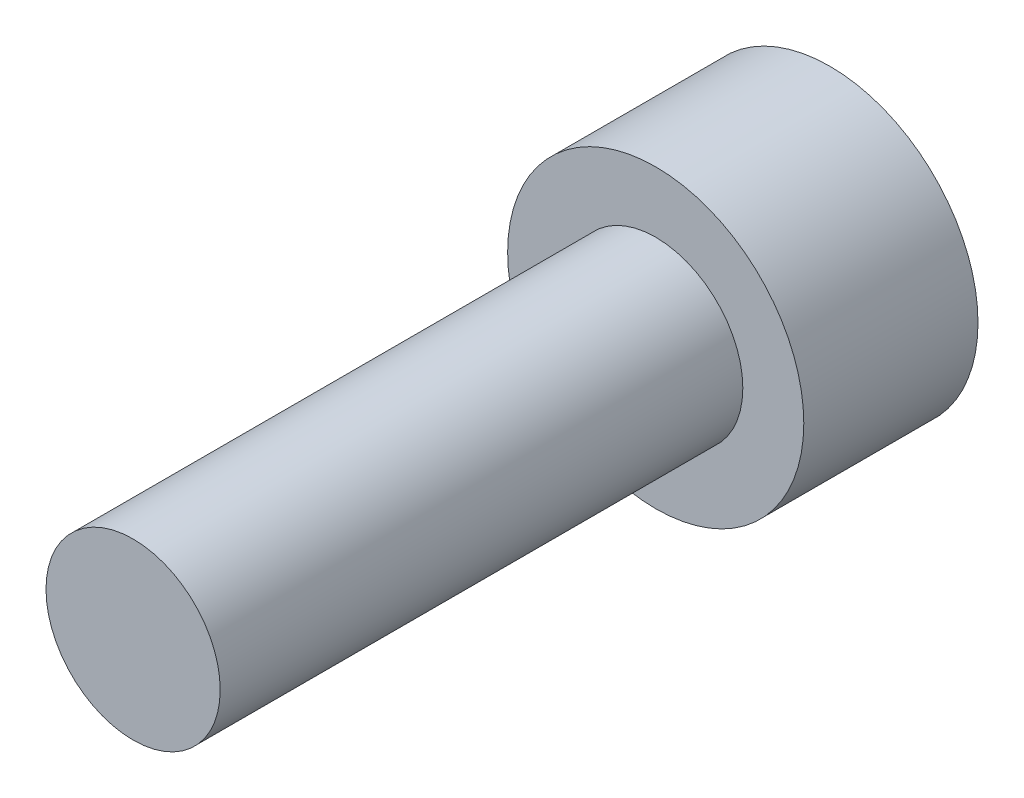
from build123d import *

# Parameters (mm, degrees)
HEX_2_DEPTH = 4


with BuildPart() as part:
    # Sketch6 → Revolve1 (revolve)
    with BuildSketch(Plane(origin=(0, 0, 0), x_dir=(0, 0, -1), z_dir=(1, 0, 0)), mode=Mode.PRIVATE) as revolve1_sk:
        Polygon((-15, 0), (-15, -2.5), (0, -2.5), (0, -4.25), (5, -4.25), (5, 0), align=None)
    revolve(revolve1_sk.sketch.rotate(Axis((0, 0, 15), (0, 0, -1)), 270), axis=Axis((0, 0, 15), (0, 0, -1)))

    # Sketch7 → HEX 2 (cut)
    with BuildSketch(Plane(origin=(0, 0, -5), x_dir=(-1, 0, 0), z_dir=(0, 0, -1))):
        Polygon((-2, 1.154700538), (-2, -1.154700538), (0, -2.309401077), (2, -1.154700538), (2, 1.154700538), (0, 2.309401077), align=None)
    extrude(amount=-HEX_2_DEPTH, mode=Mode.SUBTRACT)


solid = part.part
